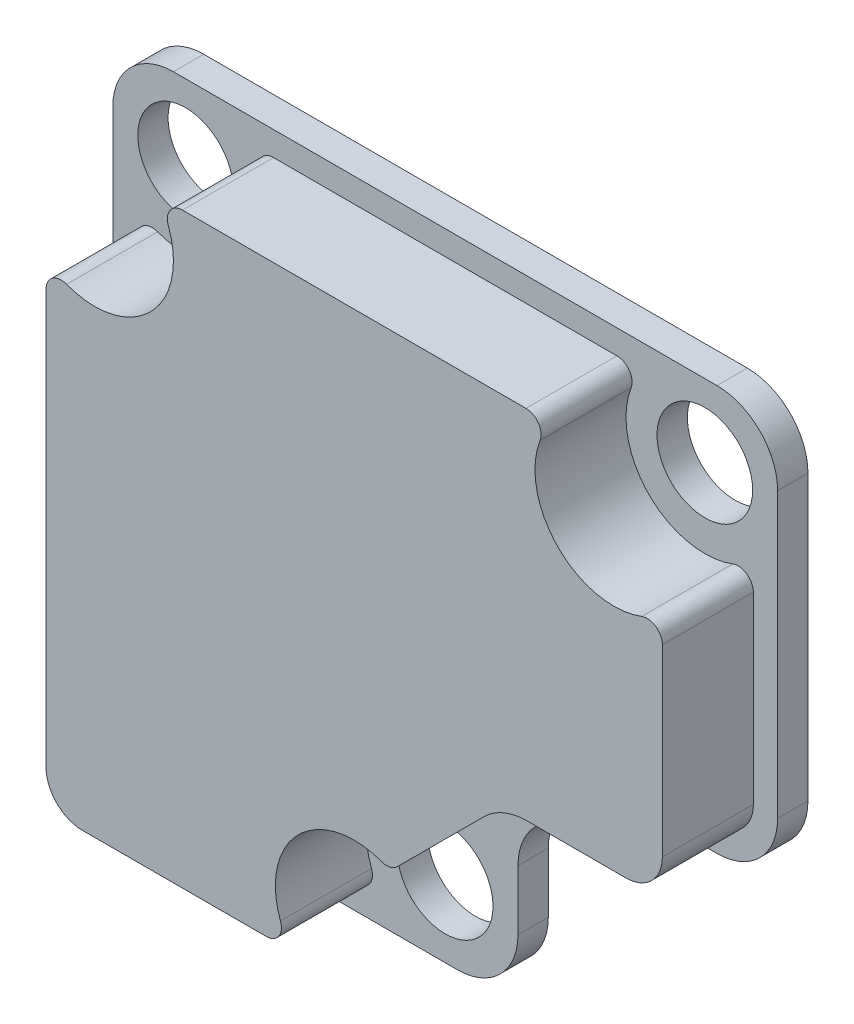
from build123d import *

# Parameters (mm, degrees)
SKETCH1_W           = 69.596
SKETCH1_H           = 66.548
SKETCH1_R           = 5.0038
BOSS_EXTRUDE1_DEPTH = 12.7
CUT_EXTRUDE1_DEPTH  = 44.45
FILLET1_R           = 6.35
FILLET2_R           = 6.35
CUT_EXTRUDE2_DEPTH  = 98.126358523
BOSS_EXTRUDE2_DEPTH = 2.54
CUT_EXTRUDE5_START  = -9.525
CUT_EXTRUDE5_DEPTH  = 9.525
CUT_EXTRUDE6_DEPTH  = 1.4986
FILLET3_R           = 1.5875


with BuildPart() as part:
    # Sketch1 → Boss-Extrude1 (new body)
    with BuildSketch(Plane.XY):
        with Locations((34.798, 33.274)):
            Rectangle(SKETCH1_W, SKETCH1_H)
        with Locations((7.62, 58.928)):
            Circle(SKETCH1_R, mode=Mode.SUBTRACT)
        with Locations((61.976, 58.928)):
            Circle(SKETCH1_R, mode=Mode.SUBTRACT)
        with Locations((34.798, 7.62)):
            Circle(SKETCH1_R, mode=Mode.SUBTRACT)
    extrude(amount=BOSS_EXTRUDE1_DEPTH)

    # Sketch4 → Cut-Extrude1 (cut)
    with BuildSketch(Plane.XY.offset(12.7)):
        Polygon((69.596, 0), (42.418, 0), (42.418, 15.24), (51.308, 24.13), (69.596, 24.13), align=None)
    extrude(amount=-CUT_EXTRUDE1_DEPTH, mode=Mode.SUBTRACT)

    # Fillet1
    fillet1_edges = [part.edges().sort_by_distance(p)[0] for p in [
        (42.418, 15.24, 6.35),
        (51.308, 24.13, 6.35),
    ]]
    fillet(fillet1_edges, radius=FILLET1_R)

    # Fillet2
    fillet2_edges = [part.edges().sort_by_distance(p)[0] for p in [
        (69.596, 24.13, 6.35),
        (42.418, 0, 6.35),
        (0, 66.548, 6.35),
        (69.596, 66.548, 6.35),
        (0, 0, 6.35),
    ]]
    fillet(fillet2_edges, radius=FILLET2_R)

    # Sketch23 → Cut-Extrude2 (cut, through all)
    with BuildSketch(Plane.XY.offset(12.7)):
        with BuildLine():
            Line((45.911629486, 61.468), (23.684370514, 61.468))
            ThreePointArc((23.684370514, 61.468), (19.74626769, 60.099349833), (17.50576647, 56.583384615))
            ThreePointArc((17.50576647, 56.583384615), (15.085400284, 52.036454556), (10.746153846, 49.260903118))
            ThreePointArc((10.746153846, 49.260903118), (7.565342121, 46.954979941), (6.35, 43.218967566))
            Line((6.35, 43.218967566), (6.35, 11.43))
            ThreePointArc((6.35, 11.43), (8.209871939, 6.939871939), (12.7, 5.08))
            Line((12.7, 5.08), (18.733629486, 5.08))
            ThreePointArc((18.733629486, 5.08), (22.67173231, 6.448650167), (24.91223353, 9.964615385))
            ThreePointArc((24.91223353, 9.964615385), (28.57992687, 15.654996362), (35.008459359, 17.777819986))
            ThreePointArc((35.008459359, 17.777819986), (37.509140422, 18.234967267), (39.630124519, 19.636329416))
            Line((39.630124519, 19.636329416), (46.059561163, 26.06576606))
            ThreePointArc((46.059561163, 26.06576606), (49.697328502, 28.394919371), (53.939256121, 29.21))
            Line((53.939256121, 29.21), (58.166, 29.21))
            ThreePointArc((58.166, 29.21), (62.656128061, 31.069871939), (64.516, 35.56))
            Line((64.516, 35.56), (64.516, 42.863629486))
            ThreePointArc((64.516, 42.863629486), (63.147349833, 46.80173231), (59.631384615, 49.04223353))
            ThreePointArc((59.631384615, 49.04223353), (54.791795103, 51.743795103), (52.09023353, 56.583384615))
            ThreePointArc((52.09023353, 56.583384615), (49.84973231, 60.099349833), (45.911629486, 61.468))
        make_face()
    extrude(amount=-CUT_EXTRUDE2_DEPTH, mode=Mode.SUBTRACT)

    # Sketch25 → Boss-Extrude2 (add)
    with BuildSketch(Plane.XY.offset(12.7)):
        with BuildLine():
            Line((6.35, 11.43), (6.35, 43.218967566))
            ThreePointArc((6.35, 43.218967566), (7.565342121, 46.954979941), (10.746153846, 49.260903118))
            ThreePointArc((10.746153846, 49.260903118), (15.085400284, 52.036454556), (17.50576647, 56.583384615))
            ThreePointArc((17.50576647, 56.583384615), (19.74626769, 60.099349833), (23.684370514, 61.468))
            Line((23.684370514, 61.468), (45.911629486, 61.468))
            ThreePointArc((45.911629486, 61.468), (49.84973231, 60.099349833), (52.09023353, 56.583384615))
            ThreePointArc((52.09023353, 56.583384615), (54.791795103, 51.743795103), (59.631384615, 49.04223353))
            ThreePointArc((59.631384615, 49.04223353), (63.147349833, 46.80173231), (64.516, 42.863629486))
            Line((64.516, 42.863629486), (64.516, 35.56))
            ThreePointArc((64.516, 35.56), (62.656128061, 31.069871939), (58.166, 29.21))
            Line((58.166, 29.21), (53.939256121, 29.21))
            ThreePointArc((53.939256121, 29.21), (49.697328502, 28.394919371), (46.059561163, 26.06576606))
            Line((46.059561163, 26.06576606), (39.630124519, 19.636329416))
            ThreePointArc((39.630124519, 19.636329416), (37.509140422, 18.234967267), (35.008459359, 17.777819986))
            ThreePointArc((35.008459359, 17.777819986), (28.57992687, 15.654996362), (24.91223353, 9.964615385))
            ThreePointArc((24.91223353, 9.964615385), (22.67173231, 6.448650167), (18.733629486, 5.08))
            Line((18.733629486, 5.08), (12.7, 5.08))
            ThreePointArc((12.7, 5.08), (8.209871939, 6.939871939), (6.35, 11.43))
        make_face()
    extrude(amount=-BOSS_EXTRUDE2_DEPTH)

    # Sketch26 → Cut-Extrude5 (cut)
    with BuildSketch(Plane.XY.offset(12.7).offset(CUT_EXTRUDE5_START)):
        with BuildLine():
            Line((0, 60.198), (0, 6.35))
            ThreePointArc((0, 6.35), (1.859871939, 1.859871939), (6.35, 0))
            Line((6.35, 0), (36.068, 0))
            ThreePointArc((36.068, 0), (40.558128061, 1.859871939), (42.418, 6.35))
            Line((42.418, 6.35), (42.418, 12.609743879))
            ThreePointArc((42.418, 12.609743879), (42.901364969, 15.039783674), (44.277871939, 17.099871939))
            Line((44.277871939, 17.099871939), (49.448128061, 22.270128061))
            ThreePointArc((49.448128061, 22.270128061), (51.508216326, 23.646635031), (53.938256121, 24.13))
            Line((53.938256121, 24.13), (63.246, 24.13))
            ThreePointArc((63.246, 24.13), (67.736128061, 25.989871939), (69.596, 30.48))
            Line((69.596, 30.48), (69.596, 60.198))
            ThreePointArc((69.596, 60.198), (67.736128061, 64.688128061), (63.246, 66.548))
            Line((63.246, 66.548), (6.35, 66.548))
            ThreePointArc((6.35, 66.548), (1.859871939, 64.688128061), (0, 60.198))
        make_face()
        with BuildLine():
            Line((14.126813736, 64.008), (55.469186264, 64.008))
            ThreePointArc((55.469186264, 64.008), (56.138833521, 53.090833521), (67.056, 52.421186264))
            Line((67.056, 52.421186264), (67.056, 30.48))
            ThreePointArc((67.056, 30.48), (65.940076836, 27.785923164), (63.246, 26.67))
            Line((63.246, 26.67), (52.886153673, 26.67))
            ThreePointArc((52.886153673, 26.67), (50.456113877, 26.186635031), (48.396025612, 24.810128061))
            Line((48.396025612, 24.810128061), (38.555930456, 14.970032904))
            ThreePointArc((38.555930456, 14.970032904), (28.432819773, 12.876377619), (28.291186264, 2.54))
            Line((28.291186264, 2.54), (6.35, 2.54))
            ThreePointArc((6.35, 2.54), (3.655923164, 3.655923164), (2.54, 6.35))
            Line((2.54, 6.35), (2.54, 52.421186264))
            ThreePointArc((2.54, 52.421186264), (13.457166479, 53.090833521), (14.126813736, 64.008))
        make_face(mode=Mode.SUBTRACT)
    extrude(amount=CUT_EXTRUDE5_DEPTH, mode=Mode.SUBTRACT)

    # Sketch28 → Cut-Extrude6 (cut)
    with BuildSketch(Plane(origin=(0, 0, 0), x_dir=(-1, 0, 0), z_dir=(0, 0, -1))):
        with BuildLine():
            Line((-47.219933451, 64.643), (-22.376066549, 64.643))
            ThreePointArc((-22.376066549, 64.643), (-17.198212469, 62.721622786), (-14.52709498, 57.887680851))
            ThreePointArc((-14.52709498, 57.887680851), (-12.559140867, 53.988859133), (-8.660319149, 52.02090502))
            ThreePointArc((-8.660319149, 52.02090502), (-3.826377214, 49.349787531), (-1.905, 44.171933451))
            Line((-1.905, 44.171933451), (-1.905, 9.8425))
            ThreePointArc((-1.905, 9.8425), (-4.229839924, 4.229839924), (-9.8425, 1.905))
            Line((-9.8425, 1.905), (-20.041933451, 1.905))
            ThreePointArc((-20.041933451, 1.905), (-25.219787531, 3.826377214), (-27.89090502, 8.660319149))
            ThreePointArc((-27.89090502, 8.660319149), (-30.416321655, 13.059772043), (-35.252720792, 14.590183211))
            ThreePointArc((-35.252720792, 14.590183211), (-38.566563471, 15.082517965), (-41.38210904, 16.898185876))
            Line((-41.38210904, 16.898185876), (-48.194083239, 23.710160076))
            ThreePointArc((-48.194083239, 23.710160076), (-50.769193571, 25.430793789), (-53.806743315, 26.035))
            Line((-53.806743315, 26.035), (-59.7535, 26.035))
            ThreePointArc((-59.7535, 26.035), (-65.366160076, 28.359839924), (-67.691, 33.9725))
            Line((-67.691, 33.9725), (-67.691, 44.171933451))
            ThreePointArc((-67.691, 44.171933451), (-65.769622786, 49.349787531), (-60.935680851, 52.02090502))
            ThreePointArc((-60.935680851, 52.02090502), (-57.036859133, 53.988859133), (-55.06890502, 57.887680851))
            ThreePointArc((-55.06890502, 57.887680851), (-52.397787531, 62.721622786), (-47.219933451, 64.643))
        make_face()
    extrude(amount=-CUT_EXTRUDE6_DEPTH, mode=Mode.SUBTRACT)

    # Fillet3
    fillet3_edges = [part.edges().sort_by_distance(p)[0] for p in [
        (14.126813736, 64.008, 7.9375),
        (55.469186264, 64.008, 7.9375),
        (67.056, 52.421186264, 7.9375),
        (38.555930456, 14.970032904, 7.9375),
        (28.291186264, 2.54, 7.9375),
        (2.54, 52.421186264, 7.9375),
    ]]
    fillet(fillet3_edges, radius=FILLET3_R)


solid = part.part
